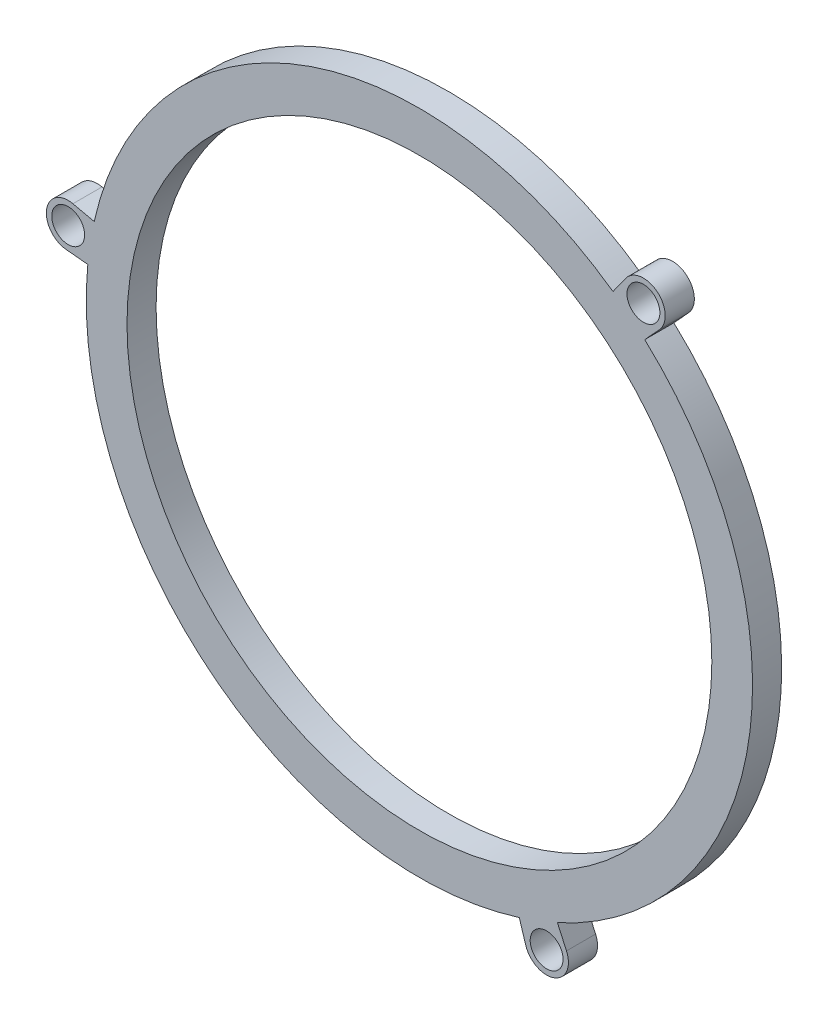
ISO-10303-21;
HEADER;
FILE_DESCRIPTION(('STEP AP214'),'2;1');
FILE_NAME('part.step','',(''),(''),'','','');
FILE_SCHEMA(('AUTOMOTIVE_DESIGN { 1 0 10303 214 1 1 1 1 }'));
ENDSEC;
DATA;
#1=APPLICATION_CONTEXT('core data for automotive mechanical design processes');
#2=APPLICATION_PROTOCOL_DEFINITION('international standard','automotive_design',2000,#1);
#3=PRODUCT_CONTEXT('',#1,'mechanical');
#4=PRODUCT('Part','Part','',(#3));
#5=PRODUCT_RELATED_PRODUCT_CATEGORY('part','',(#4));
#6=PRODUCT_DEFINITION_FORMATION('','',#4);
#7=PRODUCT_DEFINITION_CONTEXT('part definition',#1,'design');
#8=PRODUCT_DEFINITION('design','',#6,#7);
#9=PRODUCT_DEFINITION_SHAPE('','',#8);
#10=(LENGTH_UNIT() NAMED_UNIT(*) SI_UNIT(.MILLI.,.METRE.));
#11=(NAMED_UNIT(*) PLANE_ANGLE_UNIT() SI_UNIT($,.RADIAN.));
#12=(NAMED_UNIT(*) SI_UNIT($,.STERADIAN.) SOLID_ANGLE_UNIT());
#13=UNCERTAINTY_MEASURE_WITH_UNIT(LENGTH_MEASURE(1.E-05),#10,'distance_accuracy_value','');
#14=(GEOMETRIC_REPRESENTATION_CONTEXT(3) GLOBAL_UNCERTAINTY_ASSIGNED_CONTEXT((#13)) GLOBAL_UNIT_ASSIGNED_CONTEXT((#10,
#11,#12)) REPRESENTATION_CONTEXT('',''));
#15=CARTESIAN_POINT('',(0.,0.,0.));
#16=DIRECTION('',(0.,0.,1.));
#17=DIRECTION('',(1.,0.,0.));
#18=AXIS2_PLACEMENT_3D('',#15,#16,#17);
#19=CARTESIAN_POINT('',(9.11384756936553,12.9608272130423,2.54));
#20=DIRECTION('',(0.,0.,-1.));
#21=DIRECTION('',(-1.,0.,0.));
#22=AXIS2_PLACEMENT_3D('',#19,#20,#21);
#23=CYLINDRICAL_SURFACE('',#22,29.083);
#24=CARTESIAN_POINT('',(9.11384756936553,12.9608272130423,0.));
#25=DIRECTION('',(0.,0.,1.));
#26=DIRECTION('',(1.,0.,0.));
#27=AXIS2_PLACEMENT_3D('',#24,#25,#26);
#28=CIRCLE('',#27,29.083);
#29=CARTESIAN_POINT('',(21.163764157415,-13.5084077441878,0.));
#30=VERTEX_POINT('',#29);
#31=CARTESIAN_POINT('',(28.7839841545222,34.3829329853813,0.));
#32=VERTEX_POINT('',#31);
#33=EDGE_CURVE('E128',#30,#32,#28,.T.);
#34=ORIENTED_EDGE('',*,*,#33,.T.);
#35=DIRECTION('',(0.,0.,-1.));
#36=VECTOR('',#35,1.);
#37=CARTESIAN_POINT('',(28.7839841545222,34.3829329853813,2.54));
#38=LINE('',#37,#36);
#39=CARTESIAN_POINT('',(28.7839841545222,34.3829329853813,2.54));
#40=VERTEX_POINT('',#39);
#41=EDGE_CURVE('E11',#40,#32,#38,.T.);
#42=ORIENTED_EDGE('',*,*,#41,.F.);
#43=CARTESIAN_POINT('',(9.11384756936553,12.9608272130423,2.54));
#44=DIRECTION('',(0.,0.,1.));
#45=DIRECTION('',(1.,0.,0.));
#46=AXIS2_PLACEMENT_3D('',#43,#44,#45);
#47=CIRCLE('',#46,29.083);
#48=CARTESIAN_POINT('',(21.163764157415,-13.5084077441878,2.54));
#49=VERTEX_POINT('',#48);
#50=EDGE_CURVE('E182',#49,#40,#47,.T.);
#51=ORIENTED_EDGE('',*,*,#50,.F.);
#52=DIRECTION('',(0.,0.,-1.));
#53=VECTOR('',#52,1.);
#54=CARTESIAN_POINT('',(21.163764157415,-13.5084077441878,2.54));
#55=LINE('',#54,#53);
#56=EDGE_CURVE('E46',#49,#30,#55,.T.);
#57=ORIENTED_EDGE('',*,*,#56,.T.);
#58=EDGE_LOOP('',(#34,#42,#51,#57));
#59=FACE_BOUND('',#58,.T.);
#60=ADVANCED_FACE('F31',(#59),#23,.T.);
#61=CARTESIAN_POINT('',(-23.5427745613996,-22.6044374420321,2.54));
#62=DIRECTION('',(-0.736585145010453,0.676344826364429,0.));
#63=DIRECTION('',(-0.676344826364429,-0.736585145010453,0.));
#64=AXIS2_PLACEMENT_3D('',#61,#62,#63);
#65=PLANE('',#64);
#66=DIRECTION('',(0.676344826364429,0.736585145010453,0.));
#67=VECTOR('',#66,1.);
#68=CARTESIAN_POINT('',(-23.5427745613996,-22.6044374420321,0.));
#69=LINE('',#68,#67);
#70=CARTESIAN_POINT('',(30.0724210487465,35.7861276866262,0.));
#71=VERTEX_POINT('',#70);
#72=EDGE_CURVE('E123',#32,#71,#69,.T.);
#73=ORIENTED_EDGE('',*,*,#72,.T.);
#74=DIRECTION('',(0.,0.,-1.));
#75=VECTOR('',#74,1.);
#76=CARTESIAN_POINT('',(30.0724210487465,35.7861276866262,2.54));
#77=LINE('',#76,#75);
#78=CARTESIAN_POINT('',(30.0724210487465,35.7861276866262,2.54));
#79=VERTEX_POINT('',#78);
#80=EDGE_CURVE('E39',#79,#71,#77,.T.);
#81=ORIENTED_EDGE('',*,*,#80,.F.);
#82=DIRECTION('',(0.676344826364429,0.736585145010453,0.));
#83=VECTOR('',#82,1.);
#84=CARTESIAN_POINT('',(-23.5427745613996,-22.6044374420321,2.54));
#85=LINE('',#84,#83);
#86=EDGE_CURVE('E137',#40,#79,#85,.T.);
#87=ORIENTED_EDGE('',*,*,#86,.F.);
#88=ORIENTED_EDGE('',*,*,#41,.T.);
#89=EDGE_LOOP('',(#73,#81,#87,#88));
#90=FACE_BOUND('',#89,.T.);
#91=ADVANCED_FACE('F136',(#90),#65,.F.);
#92=CARTESIAN_POINT('',(28.6692263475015,37.0745645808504,2.54));
#93=DIRECTION('',(0.,0.,-1.));
#94=DIRECTION('',(-1.,0.,0.));
#95=AXIS2_PLACEMENT_3D('',#92,#93,#94);
#96=CYLINDRICAL_SURFACE('',#95,1.905);
#97=CARTESIAN_POINT('',(28.6692263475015,37.0745645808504,0.));
#98=DIRECTION('',(0.,0.,1.));
#99=DIRECTION('',(1.,0.,0.));
#100=AXIS2_PLACEMENT_3D('',#97,#98,#99);
#101=CIRCLE('',#100,1.905);
#102=CARTESIAN_POINT('',(27.118779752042,38.181425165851,0.));
#103=VERTEX_POINT('',#102);
#104=EDGE_CURVE('E131',#103,#71,#101,.F.);
#105=ORIENTED_EDGE('',*,*,#104,.F.);
#106=DIRECTION('',(0.,0.,-1.));
#107=VECTOR('',#106,1.);
#108=CARTESIAN_POINT('',(27.118779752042,38.181425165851,2.54));
#109=LINE('',#108,#107);
#110=CARTESIAN_POINT('',(27.118779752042,38.181425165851,2.54));
#111=VERTEX_POINT('',#110);
#112=EDGE_CURVE('E234',#111,#103,#109,.T.);
#113=ORIENTED_EDGE('',*,*,#112,.F.);
#114=CARTESIAN_POINT('',(28.6692263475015,37.0745645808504,2.54));
#115=DIRECTION('',(0.,0.,1.));
#116=DIRECTION('',(1.,0.,0.));
#117=AXIS2_PLACEMENT_3D('',#114,#115,#116);
#118=CIRCLE('',#117,1.905);
#119=EDGE_CURVE('E187',#111,#79,#118,.F.);
#120=ORIENTED_EDGE('',*,*,#119,.T.);
#121=ORIENTED_EDGE('',*,*,#80,.T.);
#122=EDGE_LOOP('',(#105,#113,#120,#121));
#123=FACE_BOUND('',#122,.T.);
#124=ADVANCED_FACE('F236',(#123),#96,.T.);
#125=CARTESIAN_POINT('',(-21.8279494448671,-30.3812200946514,2.54));
#126=DIRECTION('',(-0.813882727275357,0.581029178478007,0.));
#127=DIRECTION('',(-0.581029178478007,-0.813882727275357,0.));
#128=AXIS2_PLACEMENT_3D('',#125,#126,#127);
#129=PLANE('',#128);
#130=DIRECTION('',(0.581029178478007,0.813882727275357,0.));
#131=VECTOR('',#130,1.);
#132=CARTESIAN_POINT('',(-21.8279494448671,-30.3812200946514,0.));
#133=LINE('',#132,#131);
#134=CARTESIAN_POINT('',(26.0119191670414,36.6309785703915,0.));
#135=VERTEX_POINT('',#134);
#136=EDGE_CURVE('E149',#135,#103,#133,.T.);
#137=ORIENTED_EDGE('',*,*,#136,.F.);
#138=DIRECTION('',(0.,0.,-1.));
#139=VECTOR('',#138,1.);
#140=CARTESIAN_POINT('',(26.0119191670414,36.6309785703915,2.54));
#141=LINE('',#140,#139);
#142=CARTESIAN_POINT('',(26.0119191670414,36.6309785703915,2.54));
#143=VERTEX_POINT('',#142);
#144=EDGE_CURVE('E232',#143,#135,#141,.T.);
#145=ORIENTED_EDGE('',*,*,#144,.F.);
#146=DIRECTION('',(0.581029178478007,0.813882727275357,0.));
#147=VECTOR('',#146,1.);
#148=CARTESIAN_POINT('',(-21.8279494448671,-30.3812200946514,2.54));
#149=LINE('',#148,#147);
#150=EDGE_CURVE('E190',#143,#111,#149,.T.);
#151=ORIENTED_EDGE('',*,*,#150,.T.);
#152=ORIENTED_EDGE('',*,*,#112,.T.);
#153=EDGE_LOOP('',(#137,#145,#151,#152));
#154=FACE_BOUND('',#153,.T.);
#155=ADVANCED_FACE('F242',(#154),#129,.T.);
#156=CARTESIAN_POINT('',(-19.2733085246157,19.284612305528,0.));
#157=VERTEX_POINT('',#156);
#158=EDGE_CURVE('E143',#135,#157,#28,.T.);
#159=ORIENTED_EDGE('',*,*,#158,.T.);
#160=DIRECTION('',(0.,0.,-1.));
#161=VECTOR('',#160,1.);
#162=CARTESIAN_POINT('',(-19.2733085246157,19.284612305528,2.54));
#163=LINE('',#162,#161);
#164=CARTESIAN_POINT('',(-19.2733085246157,19.284612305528,2.54));
#165=VERTEX_POINT('',#164);
#166=EDGE_CURVE('E230',#165,#157,#163,.T.);
#167=ORIENTED_EDGE('',*,*,#166,.F.);
#168=EDGE_CURVE('E185',#143,#165,#47,.T.);
#169=ORIENTED_EDGE('',*,*,#168,.F.);
#170=ORIENTED_EDGE('',*,*,#144,.T.);
#171=EDGE_LOOP('',(#159,#167,#169,#170));
#172=FACE_BOUND('',#171,.T.);
#173=ADVANCED_FACE('F244',(#172),#23,.T.);
#174=CARTESIAN_POINT('',(22.3533738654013,10.0114680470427,2.54));
#175=DIRECTION('',(-0.217439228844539,-0.976073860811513,0.));
#176=DIRECTION('',(0.976073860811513,-0.217439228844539,0.));
#177=AXIS2_PLACEMENT_3D('',#174,#175,#176);
#178=PLANE('',#177);
#179=DIRECTION('',(-0.976073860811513,0.217439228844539,0.));
#180=VECTOR('',#179,1.);
#181=CARTESIAN_POINT('',(22.3533738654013,10.0114680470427,0.));
#182=LINE('',#181,#180);
#183=CARTESIAN_POINT('',(-21.1327292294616,19.6988340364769,0.));
#184=VERTEX_POINT('',#183);
#185=EDGE_CURVE('E148',#157,#184,#182,.T.);
#186=ORIENTED_EDGE('',*,*,#185,.T.);
#187=DIRECTION('',(0.,0.,-1.));
#188=VECTOR('',#187,1.);
#189=CARTESIAN_POINT('',(-21.1327292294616,19.6988340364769,2.54));
#190=LINE('',#189,#188);
#191=CARTESIAN_POINT('',(-21.1327292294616,19.6988340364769,2.54));
#192=VERTEX_POINT('',#191);
#193=EDGE_CURVE('E227',#192,#184,#190,.T.);
#194=ORIENTED_EDGE('',*,*,#193,.F.);
#195=DIRECTION('',(-0.976073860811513,0.217439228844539,0.));
#196=VECTOR('',#195,1.);
#197=CARTESIAN_POINT('',(22.3533738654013,10.0114680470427,2.54));
#198=LINE('',#197,#196);
#199=EDGE_CURVE('E193',#165,#192,#198,.T.);
#200=ORIENTED_EDGE('',*,*,#199,.F.);
#201=ORIENTED_EDGE('',*,*,#166,.T.);
#202=EDGE_LOOP('',(#186,#194,#200,#201));
#203=FACE_BOUND('',#202,.T.);
#204=ADVANCED_FACE('F282',(#203),#178,.F.);
#205=CARTESIAN_POINT('',(-21.5469509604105,17.8394133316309,2.54));
#206=DIRECTION('',(0.,0.,-1.));
#207=DIRECTION('',(-1.,0.,0.));
#208=AXIS2_PLACEMENT_3D('',#205,#206,#207);
#209=CYLINDRICAL_SURFACE('',#208,1.905);
#210=CARTESIAN_POINT('',(-21.5469509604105,17.8394133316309,0.));
#211=DIRECTION('',(0.,0.,1.));
#212=DIRECTION('',(1.,0.,0.));
#213=AXIS2_PLACEMENT_3D('',#210,#211,#212);
#214=CIRCLE('',#213,1.905);
#215=CARTESIAN_POINT('',(-21.7302970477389,15.9432569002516,0.));
#216=VERTEX_POINT('',#215);
#217=EDGE_CURVE('E154',#184,#216,#214,.T.);
#218=ORIENTED_EDGE('',*,*,#217,.T.);
#219=DIRECTION('',(0.,0.,-1.));
#220=VECTOR('',#219,1.);
#221=CARTESIAN_POINT('',(-21.7302970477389,15.9432569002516,2.54));
#222=LINE('',#221,#220);
#223=CARTESIAN_POINT('',(-21.7302970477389,15.9432569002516,2.54));
#224=VERTEX_POINT('',#223);
#225=EDGE_CURVE('E225',#224,#216,#222,.T.);
#226=ORIENTED_EDGE('',*,*,#225,.F.);
#227=CARTESIAN_POINT('',(-21.5469509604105,17.8394133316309,2.54));
#228=DIRECTION('',(0.,0.,1.));
#229=DIRECTION('',(1.,0.,0.));
#230=AXIS2_PLACEMENT_3D('',#227,#228,#229);
#231=CIRCLE('',#230,1.905);
#232=EDGE_CURVE('E195',#192,#224,#231,.T.);
#233=ORIENTED_EDGE('',*,*,#232,.F.);
#234=ORIENTED_EDGE('',*,*,#193,.T.);
#235=EDGE_LOOP('',(#218,#226,#233,#234));
#236=FACE_BOUND('',#235,.T.);
#237=ADVANCED_FACE('F289',(#236),#209,.T.);
#238=CARTESIAN_POINT('',(14.7610699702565,12.4147772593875,2.54));
#239=DIRECTION('',(-0.0962446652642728,-0.995357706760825,0.));
#240=DIRECTION('',(0.995357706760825,-0.0962446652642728,0.));
#241=AXIS2_PLACEMENT_3D('',#238,#239,#240);
#242=PLANE('',#241);
#243=DIRECTION('',(-0.995357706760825,0.0962446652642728,0.));
#244=VECTOR('',#243,1.);
#245=CARTESIAN_POINT('',(14.7610699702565,12.4147772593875,0.));
#246=LINE('',#245,#244);
#247=CARTESIAN_POINT('',(-19.8341406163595,15.7599108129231,0.));
#248=VERTEX_POINT('',#247);
#249=EDGE_CURVE('E147',#248,#216,#246,.T.);
#250=ORIENTED_EDGE('',*,*,#249,.F.);
#251=DIRECTION('',(0.,0.,-1.));
#252=VECTOR('',#251,1.);
#253=CARTESIAN_POINT('',(-19.8341406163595,15.7599108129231,2.54));
#254=LINE('',#253,#252);
#255=CARTESIAN_POINT('',(-19.8341406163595,15.7599108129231,2.54));
#256=VERTEX_POINT('',#255);
#257=EDGE_CURVE('E223',#256,#248,#254,.T.);
#258=ORIENTED_EDGE('',*,*,#257,.F.);
#259=DIRECTION('',(-0.995357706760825,0.0962446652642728,0.));
#260=VECTOR('',#259,1.);
#261=CARTESIAN_POINT('',(14.7610699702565,12.4147772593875,2.54));
#262=LINE('',#261,#260);
#263=EDGE_CURVE('E197',#256,#224,#262,.T.);
#264=ORIENTED_EDGE('',*,*,#263,.T.);
#265=ORIENTED_EDGE('',*,*,#225,.T.);
#266=EDGE_LOOP('',(#250,#258,#264,#265));
#267=FACE_BOUND('',#266,.T.);
#268=ADVANCED_FACE('F284',(#267),#242,.T.);
#269=CARTESIAN_POINT('',(17.8308670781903,-14.7850636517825,0.));
#270=VERTEX_POINT('',#269);
#271=EDGE_CURVE('E142',#248,#270,#28,.T.);
#272=ORIENTED_EDGE('',*,*,#271,.T.);
#273=DIRECTION('',(0.,0.,-1.));
#274=VECTOR('',#273,1.);
#275=CARTESIAN_POINT('',(17.8308670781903,-14.7850636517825,2.54));
#276=LINE('',#275,#274);
#277=CARTESIAN_POINT('',(17.8308670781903,-14.7850636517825,2.54));
#278=VERTEX_POINT('',#277);
#279=EDGE_CURVE('E220',#278,#270,#276,.T.);
#280=ORIENTED_EDGE('',*,*,#279,.F.);
#281=EDGE_CURVE('E184',#256,#278,#47,.T.);
#282=ORIENTED_EDGE('',*,*,#281,.F.);
#283=ORIENTED_EDGE('',*,*,#257,.T.);
#284=EDGE_LOOP('',(#272,#280,#282,#283));
#285=FACE_BOUND('',#284,.T.);
#286=ADVANCED_FACE('F252',(#285),#23,.T.);
#287=CARTESIAN_POINT('',(27.6515023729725,-46.0437151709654,2.54));
#288=DIRECTION('',(0.954024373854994,0.299729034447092,0.));
#289=DIRECTION('',(-0.299729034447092,0.954024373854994,0.));
#290=AXIS2_PLACEMENT_3D('',#287,#288,#289);
#291=PLANE('',#290);
#292=DIRECTION('',(0.299729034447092,-0.954024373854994,0.));
#293=VECTOR('',#292,1.);
#294=CARTESIAN_POINT('',(27.6515023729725,-46.0437151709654,0.));
#295=LINE('',#294,#293);
#296=CARTESIAN_POINT('',(18.401850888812,-16.6024800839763,0.));
#297=VERTEX_POINT('',#296);
#298=EDGE_CURVE('E146',#270,#297,#295,.T.);
#299=ORIENTED_EDGE('',*,*,#298,.T.);
#300=DIRECTION('',(0.,0.,-1.));
#301=VECTOR('',#300,1.);
#302=CARTESIAN_POINT('',(18.401850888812,-16.6024800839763,2.54));
#303=LINE('',#302,#301);
#304=CARTESIAN_POINT('',(18.401850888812,-16.6024800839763,2.54));
#305=VERTEX_POINT('',#304);
#306=EDGE_CURVE('E217',#305,#297,#303,.T.);
#307=ORIENTED_EDGE('',*,*,#306,.F.);
#308=DIRECTION('',(0.299729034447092,-0.954024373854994,0.));
#309=VECTOR('',#308,1.);
#310=CARTESIAN_POINT('',(27.6515023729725,-46.0437151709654,2.54));
#311=LINE('',#310,#309);
#312=EDGE_CURVE('E200',#278,#305,#311,.T.);
#313=ORIENTED_EDGE('',*,*,#312,.F.);
#314=ORIENTED_EDGE('',*,*,#279,.T.);
#315=EDGE_LOOP('',(#299,#307,#313,#314));
#316=FACE_BOUND('',#315,.T.);
#317=ADVANCED_FACE('F256',(#316),#291,.F.);
#318=CARTESIAN_POINT('',(20.2192673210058,-16.0314962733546,2.54));
#319=DIRECTION('',(0.,0.,-1.));
#320=DIRECTION('',(-1.,0.,0.));
#321=AXIS2_PLACEMENT_3D('',#318,#319,#320);
#322=CYLINDRICAL_SURFACE('',#321,1.905);
#323=CARTESIAN_POINT('',(20.2192673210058,-16.0314962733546,0.));
#324=DIRECTION('',(0.,0.,1.));
#325=DIRECTION('',(1.,0.,0.));
#326=AXIS2_PLACEMENT_3D('',#323,#324,#325);
#327=CIRCLE('',#326,1.905);
#328=CARTESIAN_POINT('',(21.9530600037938,-15.2422004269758,0.));
#329=VERTEX_POINT('',#328);
#330=EDGE_CURVE('E165',#297,#329,#327,.T.);
#331=ORIENTED_EDGE('',*,*,#330,.T.);
#332=DIRECTION('',(0.,0.,-1.));
#333=VECTOR('',#332,1.);
#334=CARTESIAN_POINT('',(21.9530600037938,-15.2422004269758,2.54));
#335=LINE('',#334,#333);
#336=CARTESIAN_POINT('',(21.9530600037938,-15.2422004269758,2.54));
#337=VERTEX_POINT('',#336);
#338=EDGE_CURVE('E215',#337,#329,#335,.T.);
#339=ORIENTED_EDGE('',*,*,#338,.F.);
#340=CARTESIAN_POINT('',(20.2192673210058,-16.0314962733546,2.54));
#341=DIRECTION('',(0.,0.,1.));
#342=DIRECTION('',(1.,0.,0.));
#343=AXIS2_PLACEMENT_3D('',#340,#341,#342);
#344=CIRCLE('',#343,1.905);
#345=EDGE_CURVE('E54',#305,#337,#344,.T.);
#346=ORIENTED_EDGE('',*,*,#345,.F.);
#347=ORIENTED_EDGE('',*,*,#306,.T.);
#348=EDGE_LOOP('',(#331,#339,#346,#347));
#349=FACE_BOUND('',#348,.T.);
#350=ADVANCED_FACE('F259',(#349),#322,.T.);
#351=CARTESIAN_POINT('',(-21.5469509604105,17.8394133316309,2.54));
#352=DIRECTION('',(0.,0.,-1.));
#353=DIRECTION('',(-1.,0.,0.));
#354=AXIS2_PLACEMENT_3D('',#351,#352,#353);
#355=CYLINDRICAL_SURFACE('',#354,1.4351);
#356=CARTESIAN_POINT('',(-21.5469509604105,17.8394133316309,2.54));
#357=DIRECTION('',(0.,0.,1.));
#358=DIRECTION('',(1.,0.,0.));
#359=AXIS2_PLACEMENT_3D('',#356,#357,#358);
#360=CIRCLE('',#359,1.4351);
#361=CARTESIAN_POINT('',(-20.1118509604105,17.8394133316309,2.54));
#362=VERTEX_POINT('',#361);
#363=EDGE_CURVE('E208',#362,#362,#360,.T.);
#364=ORIENTED_EDGE('',*,*,#363,.T.);
#365=EDGE_LOOP('',(#364));
#366=FACE_BOUND('',#365,.T.);
#367=CARTESIAN_POINT('',(-21.5469509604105,17.8394133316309,0.));
#368=DIRECTION('',(0.,0.,1.));
#369=DIRECTION('',(1.,0.,0.));
#370=AXIS2_PLACEMENT_3D('',#367,#368,#369);
#371=CIRCLE('',#370,1.4351);
#372=CARTESIAN_POINT('',(-20.1118509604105,17.8394133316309,0.));
#373=VERTEX_POINT('',#372);
#374=EDGE_CURVE('E173',#373,#373,#371,.T.);
#375=ORIENTED_EDGE('',*,*,#374,.F.);
#376=EDGE_LOOP('',(#375));
#377=FACE_BOUND('',#376,.T.);
#378=ADVANCED_FACE('F270',(#366,#377),#355,.F.);
#379=CARTESIAN_POINT('',(20.2192673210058,-16.0314962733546,2.54));
#380=DIRECTION('',(0.,0.,-1.));
#381=DIRECTION('',(-1.,0.,0.));
#382=AXIS2_PLACEMENT_3D('',#379,#380,#381);
#383=CYLINDRICAL_SURFACE('',#382,1.4351);
#384=CARTESIAN_POINT('',(20.2192673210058,-16.0314962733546,2.54));
#385=DIRECTION('',(0.,0.,1.));
#386=DIRECTION('',(1.,0.,0.));
#387=AXIS2_PLACEMENT_3D('',#384,#385,#386);
#388=CIRCLE('',#387,1.4351);
#389=CARTESIAN_POINT('',(21.6543673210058,-16.0314962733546,2.54));
#390=VERTEX_POINT('',#389);
#391=EDGE_CURVE('E205',#390,#390,#388,.T.);
#392=ORIENTED_EDGE('',*,*,#391,.T.);
#393=EDGE_LOOP('',(#392));
#394=FACE_BOUND('',#393,.T.);
#395=CARTESIAN_POINT('',(20.2192673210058,-16.0314962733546,0.));
#396=DIRECTION('',(0.,0.,1.));
#397=DIRECTION('',(1.,0.,0.));
#398=AXIS2_PLACEMENT_3D('',#395,#396,#397);
#399=CIRCLE('',#398,1.4351);
#400=CARTESIAN_POINT('',(21.6543673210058,-16.0314962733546,0.));
#401=VERTEX_POINT('',#400);
#402=EDGE_CURVE('E170',#401,#401,#399,.T.);
#403=ORIENTED_EDGE('',*,*,#402,.F.);
#404=EDGE_LOOP('',(#403));
#405=FACE_BOUND('',#404,.T.);
#406=ADVANCED_FACE('F262',(#394,#405),#383,.F.);
#407=CARTESIAN_POINT('',(33.5289811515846,-40.6702417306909,2.54));
#408=DIRECTION('',(0.91012739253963,0.414328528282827,0.));
#409=DIRECTION('',(-0.414328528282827,0.91012739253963,0.));
#410=AXIS2_PLACEMENT_3D('',#407,#408,#409);
#411=PLANE('',#410);
#412=DIRECTION('',(0.414328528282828,-0.91012739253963,0.));
#413=VECTOR('',#412,1.);
#414=CARTESIAN_POINT('',(33.5289811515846,-40.6702417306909,0.));
#415=LINE('',#414,#413);
#416=EDGE_CURVE('E168',#30,#329,#415,.T.);
#417=ORIENTED_EDGE('',*,*,#416,.F.);
#418=ORIENTED_EDGE('',*,*,#56,.F.);
#419=DIRECTION('',(0.414328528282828,-0.91012739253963,0.));
#420=VECTOR('',#419,1.);
#421=CARTESIAN_POINT('',(33.5289811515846,-40.6702417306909,2.54));
#422=LINE('',#421,#420);
#423=EDGE_CURVE('E203',#49,#337,#422,.T.);
#424=ORIENTED_EDGE('',*,*,#423,.T.);
#425=ORIENTED_EDGE('',*,*,#338,.T.);
#426=EDGE_LOOP('',(#417,#418,#424,#425));
#427=FACE_BOUND('',#426,.T.);
#428=ADVANCED_FACE('F260',(#427),#411,.T.);
#429=CARTESIAN_POINT('',(9.11384756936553,12.9608272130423,2.54));
#430=DIRECTION('',(0.,0.,-1.));
#431=DIRECTION('',(-1.,0.,0.));
#432=AXIS2_PLACEMENT_3D('',#429,#430,#431);
#433=CYLINDRICAL_SURFACE('',#432,25.527);
#434=CARTESIAN_POINT('',(9.11384756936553,12.9608272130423,2.54));
#435=DIRECTION('',(0.,0.,1.));
#436=DIRECTION('',(1.,0.,0.));
#437=AXIS2_PLACEMENT_3D('',#434,#435,#436);
#438=CIRCLE('',#437,25.527);
#439=CARTESIAN_POINT('',(34.6408475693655,12.9608272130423,2.54));
#440=VERTEX_POINT('',#439);
#441=EDGE_CURVE('E179',#440,#440,#438,.T.);
#442=ORIENTED_EDGE('',*,*,#441,.T.);
#443=EDGE_LOOP('',(#442));
#444=FACE_BOUND('',#443,.T.);
#445=CARTESIAN_POINT('',(9.11384756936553,12.9608272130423,0.));
#446=DIRECTION('',(0.,0.,1.));
#447=DIRECTION('',(1.,0.,0.));
#448=AXIS2_PLACEMENT_3D('',#445,#446,#447);
#449=CIRCLE('',#448,25.527);
#450=CARTESIAN_POINT('',(34.6408475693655,12.9608272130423,0.));
#451=VERTEX_POINT('',#450);
#452=EDGE_CURVE('E140',#451,#451,#449,.T.);
#453=ORIENTED_EDGE('',*,*,#452,.F.);
#454=EDGE_LOOP('',(#453));
#455=FACE_BOUND('',#454,.T.);
#456=ADVANCED_FACE('F33',(#444,#455),#433,.F.);
#457=CARTESIAN_POINT('',(28.6692263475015,37.0745645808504,2.54));
#458=DIRECTION('',(0.,0.,-1.));
#459=DIRECTION('',(-1.,0.,0.));
#460=AXIS2_PLACEMENT_3D('',#457,#458,#459);
#461=CYLINDRICAL_SURFACE('',#460,1.4351);
#462=CARTESIAN_POINT('',(28.6692263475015,37.0745645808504,2.54));
#463=DIRECTION('',(0.,0.,1.));
#464=DIRECTION('',(1.,0.,0.));
#465=AXIS2_PLACEMENT_3D('',#462,#463,#464);
#466=CIRCLE('',#465,1.4351);
#467=CARTESIAN_POINT('',(30.1043263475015,37.0745645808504,2.54));
#468=VERTEX_POINT('',#467);
#469=EDGE_CURVE('E211',#468,#468,#466,.T.);
#470=ORIENTED_EDGE('',*,*,#469,.T.);
#471=EDGE_LOOP('',(#470));
#472=FACE_BOUND('',#471,.T.);
#473=CARTESIAN_POINT('',(28.6692263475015,37.0745645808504,0.));
#474=DIRECTION('',(0.,0.,1.));
#475=DIRECTION('',(1.,0.,0.));
#476=AXIS2_PLACEMENT_3D('',#473,#474,#475);
#477=CIRCLE('',#476,1.4351);
#478=CARTESIAN_POINT('',(30.1043263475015,37.0745645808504,0.));
#479=VERTEX_POINT('',#478);
#480=EDGE_CURVE('E176',#479,#479,#477,.T.);
#481=ORIENTED_EDGE('',*,*,#480,.F.);
#482=EDGE_LOOP('',(#481));
#483=FACE_BOUND('',#482,.T.);
#484=ADVANCED_FACE('F268',(#472,#483),#461,.F.);
#485=CARTESIAN_POINT('',(8.52755354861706,-52.0519502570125,2.54));
#486=DIRECTION('',(0.,0.,1.));
#487=DIRECTION('',(1.,0.,0.));
#488=AXIS2_PLACEMENT_3D('',#485,#486,#487);
#489=PLANE('',#488);
#490=ORIENTED_EDGE('',*,*,#441,.F.);
#491=EDGE_LOOP('',(#490));
#492=FACE_BOUND('',#491,.T.);
#493=ORIENTED_EDGE('',*,*,#50,.T.);
#494=ORIENTED_EDGE('',*,*,#86,.T.);
#495=ORIENTED_EDGE('',*,*,#119,.F.);
#496=ORIENTED_EDGE('',*,*,#150,.F.);
#497=ORIENTED_EDGE('',*,*,#168,.T.);
#498=ORIENTED_EDGE('',*,*,#199,.T.);
#499=ORIENTED_EDGE('',*,*,#232,.T.);
#500=ORIENTED_EDGE('',*,*,#263,.F.);
#501=ORIENTED_EDGE('',*,*,#281,.T.);
#502=ORIENTED_EDGE('',*,*,#312,.T.);
#503=ORIENTED_EDGE('',*,*,#345,.T.);
#504=ORIENTED_EDGE('',*,*,#423,.F.);
#505=EDGE_LOOP('',(#493,#494,#495,#496,#497,#498,#499,#500,#501,#502,#503,#504));
#506=FACE_BOUND('',#505,.T.);
#507=ORIENTED_EDGE('',*,*,#391,.F.);
#508=EDGE_LOOP('',(#507));
#509=FACE_BOUND('',#508,.T.);
#510=ORIENTED_EDGE('',*,*,#363,.F.);
#511=EDGE_LOOP('',(#510));
#512=FACE_BOUND('',#511,.T.);
#513=ORIENTED_EDGE('',*,*,#469,.F.);
#514=EDGE_LOOP('',(#513));
#515=FACE_BOUND('',#514,.T.);
#516=ADVANCED_FACE('F239',(#492,#506,#509,#512,#515),#489,.T.);
#517=CARTESIAN_POINT('',(8.52755354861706,-52.0519502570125,0.));
#518=DIRECTION('',(0.,0.,1.));
#519=DIRECTION('',(1.,0.,0.));
#520=AXIS2_PLACEMENT_3D('',#517,#518,#519);
#521=PLANE('',#520);
#522=ORIENTED_EDGE('',*,*,#452,.T.);
#523=EDGE_LOOP('',(#522));
#524=FACE_BOUND('',#523,.T.);
#525=ORIENTED_EDGE('',*,*,#33,.F.);
#526=ORIENTED_EDGE('',*,*,#416,.T.);
#527=ORIENTED_EDGE('',*,*,#330,.F.);
#528=ORIENTED_EDGE('',*,*,#298,.F.);
#529=ORIENTED_EDGE('',*,*,#271,.F.);
#530=ORIENTED_EDGE('',*,*,#249,.T.);
#531=ORIENTED_EDGE('',*,*,#217,.F.);
#532=ORIENTED_EDGE('',*,*,#185,.F.);
#533=ORIENTED_EDGE('',*,*,#158,.F.);
#534=ORIENTED_EDGE('',*,*,#136,.T.);
#535=ORIENTED_EDGE('',*,*,#104,.T.);
#536=ORIENTED_EDGE('',*,*,#72,.F.);
#537=EDGE_LOOP('',(#525,#526,#527,#528,#529,#530,#531,#532,#533,#534,#535,#536));
#538=FACE_BOUND('',#537,.T.);
#539=ORIENTED_EDGE('',*,*,#402,.T.);
#540=EDGE_LOOP('',(#539));
#541=FACE_BOUND('',#540,.T.);
#542=ORIENTED_EDGE('',*,*,#374,.T.);
#543=EDGE_LOOP('',(#542));
#544=FACE_BOUND('',#543,.T.);
#545=ORIENTED_EDGE('',*,*,#480,.T.);
#546=EDGE_LOOP('',(#545));
#547=FACE_BOUND('',#546,.T.);
#548=ADVANCED_FACE('F124',(#524,#538,#541,#544,#547),#521,.F.);
#549=CLOSED_SHELL('',(#60,#91,#124,#155,#173,#204,#237,#268,#286,#317,#350,#378,#406,#428,#456,
#484,#516,#548));
#550=MANIFOLD_SOLID_BREP('B2',#549);
#551=ADVANCED_BREP_SHAPE_REPRESENTATION('',(#18,#550),#14);
#552=SHAPE_DEFINITION_REPRESENTATION(#9,#551);
ENDSEC;
END-ISO-10303-21;
